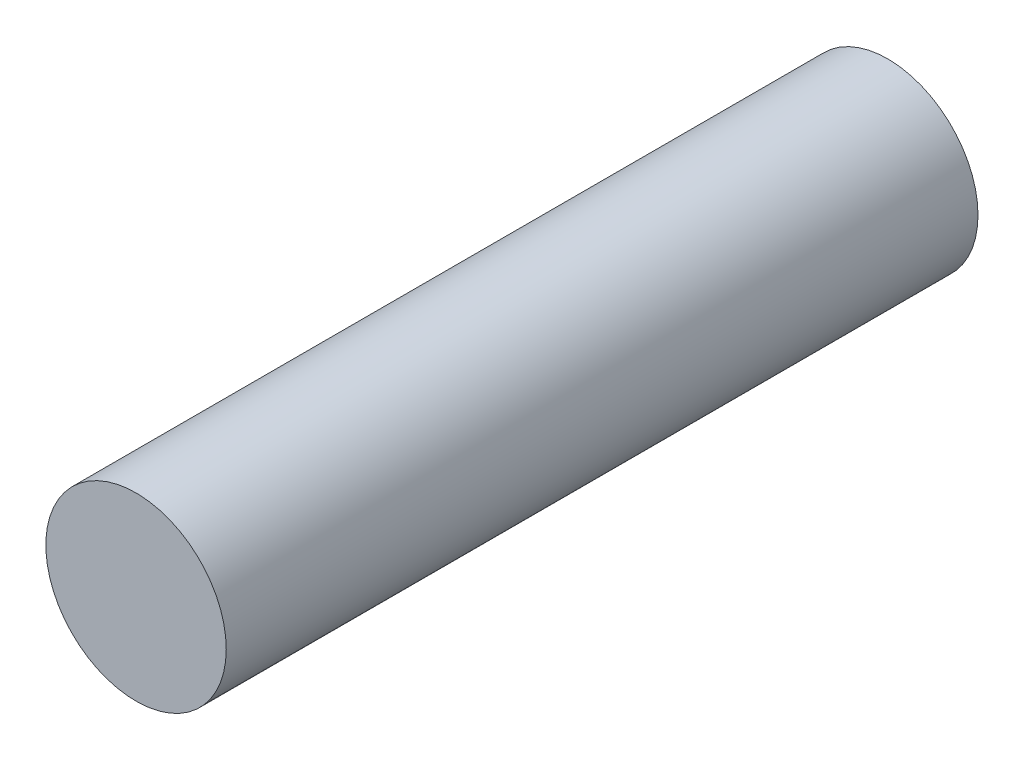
from build123d import *

# Parameters (mm, degrees)
SKETCH1_R           = 30
BOSS_EXTRUDE1_DEPTH = 250


with BuildPart() as part:
    # Sketch1 → Boss-Extrude1 (new body)
    with BuildSketch(Plane.XY):
        Circle(SKETCH1_R)
    extrude(amount=-BOSS_EXTRUDE1_DEPTH)


solid = part.part
